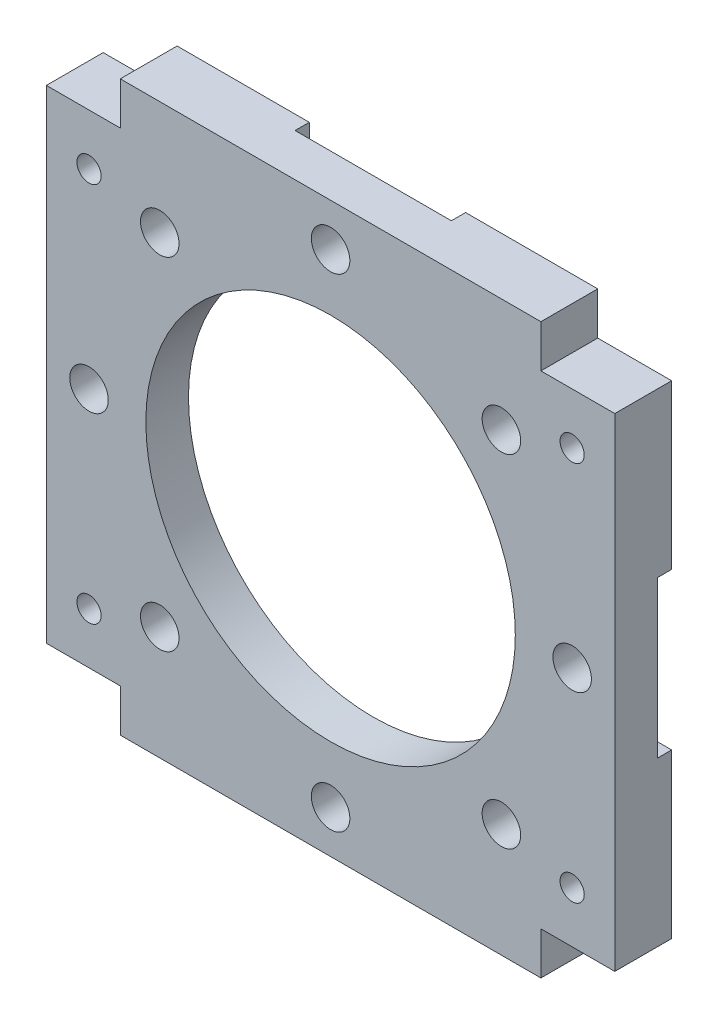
ISO-10303-21;
HEADER;
FILE_DESCRIPTION(('STEP AP214'),'2;1');
FILE_NAME('part.step','',(''),(''),'','','');
FILE_SCHEMA(('AUTOMOTIVE_DESIGN { 1 0 10303 214 1 1 1 1 }'));
ENDSEC;
DATA;
#1=APPLICATION_CONTEXT('core data for automotive mechanical design processes');
#2=APPLICATION_PROTOCOL_DEFINITION('international standard','automotive_design',2000,#1);
#3=PRODUCT_CONTEXT('',#1,'mechanical');
#4=PRODUCT('Part','Part','',(#3));
#5=PRODUCT_RELATED_PRODUCT_CATEGORY('part','',(#4));
#6=PRODUCT_DEFINITION_FORMATION('','',#4);
#7=PRODUCT_DEFINITION_CONTEXT('part definition',#1,'design');
#8=PRODUCT_DEFINITION('design','',#6,#7);
#9=PRODUCT_DEFINITION_SHAPE('','',#8);
#10=(LENGTH_UNIT() NAMED_UNIT(*) SI_UNIT(.MILLI.,.METRE.));
#11=(NAMED_UNIT(*) PLANE_ANGLE_UNIT() SI_UNIT($,.RADIAN.));
#12=(NAMED_UNIT(*) SI_UNIT($,.STERADIAN.) SOLID_ANGLE_UNIT());
#13=UNCERTAINTY_MEASURE_WITH_UNIT(LENGTH_MEASURE(1.E-05),#10,'distance_accuracy_value','');
#14=(GEOMETRIC_REPRESENTATION_CONTEXT(3) GLOBAL_UNCERTAINTY_ASSIGNED_CONTEXT((#13)) GLOBAL_UNIT_ASSIGNED_CONTEXT((#10,
#11,#12)) REPRESENTATION_CONTEXT('',''));
#15=CARTESIAN_POINT('',(0.,0.,0.));
#16=DIRECTION('',(0.,0.,1.));
#17=DIRECTION('',(1.,0.,0.));
#18=AXIS2_PLACEMENT_3D('',#15,#16,#17);
#19=CARTESIAN_POINT('',(31.75,26.9875,4.7625));
#20=DIRECTION('',(-1.,0.,0.));
#21=DIRECTION('',(0.,-1.,0.));
#22=AXIS2_PLACEMENT_3D('',#19,#20,#21);
#23=PLANE('',#22);
#24=DIRECTION('',(0.,0.,1.));
#25=VECTOR('',#24,1.);
#26=CARTESIAN_POINT('',(31.75,8.73125,4.7625));
#27=LINE('',#26,#25);
#28=CARTESIAN_POINT('',(31.75,8.73125,-1.58750000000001));
#29=VERTEX_POINT('',#28);
#30=CARTESIAN_POINT('',(31.75,8.73125,0.));
#31=VERTEX_POINT('',#30);
#32=EDGE_CURVE('E388',#29,#31,#27,.T.);
#33=ORIENTED_EDGE('',*,*,#32,.F.);
#34=DIRECTION('',(0.,1.,0.));
#35=VECTOR('',#34,1.);
#36=CARTESIAN_POINT('',(31.75,26.9875,-1.58750000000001));
#37=LINE('',#36,#35);
#38=CARTESIAN_POINT('',(31.75,26.9875,-1.58750000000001));
#39=VERTEX_POINT('',#38);
#40=EDGE_CURVE('E319',#29,#39,#37,.T.);
#41=ORIENTED_EDGE('',*,*,#40,.T.);
#42=DIRECTION('',(0.,0.,-1.));
#43=VECTOR('',#42,1.);
#44=CARTESIAN_POINT('',(31.75,26.9875,4.7625));
#45=LINE('',#44,#43);
#46=CARTESIAN_POINT('',(31.75,26.9875,4.7625));
#47=VERTEX_POINT('',#46);
#48=EDGE_CURVE('E11',#47,#39,#45,.T.);
#49=ORIENTED_EDGE('',*,*,#48,.F.);
#50=DIRECTION('',(0.,1.,0.));
#51=VECTOR('',#50,1.);
#52=CARTESIAN_POINT('',(31.75,26.9875,4.7625));
#53=LINE('',#52,#51);
#54=CARTESIAN_POINT('',(31.75,-26.9875,4.76249999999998));
#55=VERTEX_POINT('',#54);
#56=EDGE_CURVE('E350',#55,#47,#53,.T.);
#57=ORIENTED_EDGE('',*,*,#56,.F.);
#58=DIRECTION('',(0.,0.,-1.));
#59=VECTOR('',#58,1.);
#60=CARTESIAN_POINT('',(31.75,-26.9875,4.76249999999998));
#61=LINE('',#60,#59);
#62=CARTESIAN_POINT('',(31.75,-26.9875,-1.58750000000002));
#63=VERTEX_POINT('',#62);
#64=EDGE_CURVE('E413',#55,#63,#61,.T.);
#65=ORIENTED_EDGE('',*,*,#64,.T.);
#66=CARTESIAN_POINT('',(31.75,-8.73125,-1.58750000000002));
#67=VERTEX_POINT('',#66);
#68=EDGE_CURVE('E375',#63,#67,#37,.T.);
#69=ORIENTED_EDGE('',*,*,#68,.T.);
#70=DIRECTION('',(0.,0.,-1.));
#71=VECTOR('',#70,1.);
#72=CARTESIAN_POINT('',(31.75,-8.73125,4.76249999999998));
#73=LINE('',#72,#71);
#74=CARTESIAN_POINT('',(31.75,-8.73125,0.));
#75=VERTEX_POINT('',#74);
#76=EDGE_CURVE('E428',#75,#67,#73,.T.);
#77=ORIENTED_EDGE('',*,*,#76,.F.);
#78=DIRECTION('',(0.,-1.,0.));
#79=VECTOR('',#78,1.);
#80=CARTESIAN_POINT('',(31.75,26.9875,0.));
#81=LINE('',#80,#79);
#82=EDGE_CURVE('E444',#31,#75,#81,.T.);
#83=ORIENTED_EDGE('',*,*,#82,.F.);
#84=EDGE_LOOP('',(#33,#41,#49,#57,#65,#69,#77,#83));
#85=FACE_BOUND('',#84,.T.);
#86=ADVANCED_FACE('F33',(#85),#23,.F.);
#87=CARTESIAN_POINT('',(-31.75,-26.9875,4.7625));
#88=DIRECTION('',(1.,0.,0.));
#89=DIRECTION('',(0.,0.,-1.));
#90=AXIS2_PLACEMENT_3D('',#87,#88,#89);
#91=PLANE('',#90);
#92=DIRECTION('',(0.,0.,1.));
#93=VECTOR('',#92,1.);
#94=CARTESIAN_POINT('',(-31.75,-8.73125,4.7625));
#95=LINE('',#94,#93);
#96=CARTESIAN_POINT('',(-31.75,-8.73125,-1.58750000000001));
#97=VERTEX_POINT('',#96);
#98=CARTESIAN_POINT('',(-31.75,-8.73125,0.));
#99=VERTEX_POINT('',#98);
#100=EDGE_CURVE('E469',#97,#99,#95,.T.);
#101=ORIENTED_EDGE('',*,*,#100,.F.);
#102=DIRECTION('',(0.,-1.,0.));
#103=VECTOR('',#102,1.);
#104=CARTESIAN_POINT('',(-31.75,-26.9875,-1.58749999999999));
#105=LINE('',#104,#103);
#106=CARTESIAN_POINT('',(-31.75,-26.9875,-1.58749999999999));
#107=VERTEX_POINT('',#106);
#108=EDGE_CURVE('E398',#97,#107,#105,.T.);
#109=ORIENTED_EDGE('',*,*,#108,.T.);
#110=DIRECTION('',(0.,0.,-1.));
#111=VECTOR('',#110,1.);
#112=CARTESIAN_POINT('',(-31.75,-26.9875,4.7625));
#113=LINE('',#112,#111);
#114=CARTESIAN_POINT('',(-31.75,-26.9875,4.7625));
#115=VERTEX_POINT('',#114);
#116=EDGE_CURVE('E416',#115,#107,#113,.T.);
#117=ORIENTED_EDGE('',*,*,#116,.F.);
#118=DIRECTION('',(0.,-1.,0.));
#119=VECTOR('',#118,1.);
#120=CARTESIAN_POINT('',(-31.75,-26.9875,4.7625));
#121=LINE('',#120,#119);
#122=CARTESIAN_POINT('',(-31.75,26.9875,4.76250000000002));
#123=VERTEX_POINT('',#122);
#124=EDGE_CURVE('E364',#123,#115,#121,.T.);
#125=ORIENTED_EDGE('',*,*,#124,.F.);
#126=DIRECTION('',(0.,0.,-1.));
#127=VECTOR('',#126,1.);
#128=CARTESIAN_POINT('',(-31.75,26.9875,4.76250000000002));
#129=LINE('',#128,#127);
#130=CARTESIAN_POINT('',(-31.75,26.9875,-1.58749999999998));
#131=VERTEX_POINT('',#130);
#132=EDGE_CURVE('E41',#123,#131,#129,.T.);
#133=ORIENTED_EDGE('',*,*,#132,.T.);
#134=CARTESIAN_POINT('',(-31.75,8.73125,-1.58749999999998));
#135=VERTEX_POINT('',#134);
#136=EDGE_CURVE('E356',#131,#135,#105,.T.);
#137=ORIENTED_EDGE('',*,*,#136,.T.);
#138=DIRECTION('',(0.,0.,-1.));
#139=VECTOR('',#138,1.);
#140=CARTESIAN_POINT('',(-31.75,8.73125,4.76250000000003));
#141=LINE('',#140,#139);
#142=CARTESIAN_POINT('',(-31.75,8.73125,0.));
#143=VERTEX_POINT('',#142);
#144=EDGE_CURVE('E462',#143,#135,#141,.T.);
#145=ORIENTED_EDGE('',*,*,#144,.F.);
#146=DIRECTION('',(0.,1.,0.));
#147=VECTOR('',#146,1.);
#148=CARTESIAN_POINT('',(-31.75,-26.9875,0.));
#149=LINE('',#148,#147);
#150=EDGE_CURVE('E231',#99,#143,#149,.T.);
#151=ORIENTED_EDGE('',*,*,#150,.F.);
#152=EDGE_LOOP('',(#101,#109,#117,#125,#133,#137,#145,#151));
#153=FACE_BOUND('',#152,.T.);
#154=ADVANCED_FACE('F507',(#153),#91,.F.);
#155=CARTESIAN_POINT('',(31.75,26.9875,-1.58750000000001));
#156=DIRECTION('',(0.,0.,-1.));
#157=DIRECTION('',(-1.,0.,0.));
#158=AXIS2_PLACEMENT_3D('',#155,#156,#157);
#159=PLANE('',#158);
#160=CARTESIAN_POINT('',(26.9875000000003,21.2687500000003,-1.58750000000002));
#161=DIRECTION('',(0.,0.,-1.));
#162=DIRECTION('',(-1.,0.,0.));
#163=AXIS2_PLACEMENT_3D('',#160,#161,#162);
#164=CIRCLE('',#163,1.35254999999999);
#165=CARTESIAN_POINT('',(25.6349500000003,21.2687500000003,-1.58750000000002));
#166=VERTEX_POINT('',#165);
#167=EDGE_CURVE('E242',#166,#166,#164,.T.);
#168=ORIENTED_EDGE('',*,*,#167,.F.);
#169=EDGE_LOOP('',(#168));
#170=FACE_BOUND('',#169,.T.);
#171=CARTESIAN_POINT('',(0.,2.41368637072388E-13,-1.58750000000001));
#172=DIRECTION('',(0.,0.,-1.));
#173=DIRECTION('',(-1.,0.,0.));
#174=AXIS2_PLACEMENT_3D('',#171,#172,#173);
#175=CIRCLE('',#174,30.2133);
#176=CARTESIAN_POINT('',(8.73125,28.9241900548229,-1.58749999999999));
#177=VERTEX_POINT('',#176);
#178=CARTESIAN_POINT('',(28.9241900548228,8.73125,-1.58749999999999));
#179=VERTEX_POINT('',#178);
#180=EDGE_CURVE('E264',#177,#179,#175,.T.);
#181=ORIENTED_EDGE('',*,*,#180,.F.);
#182=DIRECTION('',(0.,1.,0.));
#183=VECTOR('',#182,1.);
#184=CARTESIAN_POINT('',(8.73125,26.9875,-1.58749999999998));
#185=LINE('',#184,#183);
#186=CARTESIAN_POINT('',(8.73125,31.75,-1.58749999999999));
#187=VERTEX_POINT('',#186);
#188=EDGE_CURVE('E249',#177,#187,#185,.T.);
#189=ORIENTED_EDGE('',*,*,#188,.T.);
#190=DIRECTION('',(-1.,0.,0.));
#191=VECTOR('',#190,1.);
#192=CARTESIAN_POINT('',(-23.495,31.75,-1.58750000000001));
#193=LINE('',#192,#191);
#194=CARTESIAN_POINT('',(23.495,31.75,-1.58750000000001));
#195=VERTEX_POINT('',#194);
#196=EDGE_CURVE('E247',#195,#187,#193,.T.);
#197=ORIENTED_EDGE('',*,*,#196,.F.);
#198=DIRECTION('',(0.,1.,0.));
#199=VECTOR('',#198,1.);
#200=CARTESIAN_POINT('',(23.495,26.9875,-1.58749999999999));
#201=LINE('',#200,#199);
#202=CARTESIAN_POINT('',(23.495,26.9875,-1.58749999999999));
#203=VERTEX_POINT('',#202);
#204=EDGE_CURVE('E333',#203,#195,#201,.T.);
#205=ORIENTED_EDGE('',*,*,#204,.F.);
#206=DIRECTION('',(-1.,0.,0.));
#207=VECTOR('',#206,1.);
#208=CARTESIAN_POINT('',(31.75,26.9875,-1.58750000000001));
#209=LINE('',#208,#207);
#210=EDGE_CURVE('E374',#39,#203,#209,.T.);
#211=ORIENTED_EDGE('',*,*,#210,.F.);
#212=ORIENTED_EDGE('',*,*,#40,.F.);
#213=DIRECTION('',(-1.,0.,0.));
#214=VECTOR('',#213,1.);
#215=CARTESIAN_POINT('',(31.75,8.73125,-1.58750000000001));
#216=LINE('',#215,#214);
#217=EDGE_CURVE('E438',#29,#179,#216,.T.);
#218=ORIENTED_EDGE('',*,*,#217,.T.);
#219=EDGE_LOOP('',(#181,#189,#197,#205,#211,#212,#218));
#220=FACE_BOUND('',#219,.T.);
#221=ADVANCED_FACE('F397',(#170,#220),#159,.T.);
#222=CARTESIAN_POINT('',(26.9875,-21.2687499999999,-1.58749999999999));
#223=DIRECTION('',(0.,0.,-1.));
#224=DIRECTION('',(-1.,0.,0.));
#225=AXIS2_PLACEMENT_3D('',#222,#223,#224);
#226=CIRCLE('',#225,1.35254999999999);
#227=CARTESIAN_POINT('',(25.63495,-21.2687499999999,-1.58749999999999));
#228=VERTEX_POINT('',#227);
#229=EDGE_CURVE('E553',#228,#228,#226,.T.);
#230=ORIENTED_EDGE('',*,*,#229,.F.);
#231=EDGE_LOOP('',(#230));
#232=FACE_BOUND('',#231,.T.);
#233=CARTESIAN_POINT('',(28.9241900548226,-8.73125,-1.58750000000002));
#234=VERTEX_POINT('',#233);
#235=CARTESIAN_POINT('',(8.73125,-28.9241900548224,-1.58749999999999));
#236=VERTEX_POINT('',#235);
#237=EDGE_CURVE('E425',#234,#236,#175,.T.);
#238=ORIENTED_EDGE('',*,*,#237,.F.);
#239=DIRECTION('',(1.,0.,0.));
#240=VECTOR('',#239,1.);
#241=CARTESIAN_POINT('',(31.75,-8.73125,-1.58750000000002));
#242=LINE('',#241,#240);
#243=EDGE_CURVE('E422',#234,#67,#242,.T.);
#244=ORIENTED_EDGE('',*,*,#243,.T.);
#245=ORIENTED_EDGE('',*,*,#68,.F.);
#246=DIRECTION('',(1.,0.,0.));
#247=VECTOR('',#246,1.);
#248=CARTESIAN_POINT('',(31.75,-26.9875,-1.58750000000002));
#249=LINE('',#248,#247);
#250=CARTESIAN_POINT('',(23.495,-26.9875,-1.58750000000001));
#251=VERTEX_POINT('',#250);
#252=EDGE_CURVE('E351',#251,#63,#249,.T.);
#253=ORIENTED_EDGE('',*,*,#252,.F.);
#254=DIRECTION('',(0.,1.,0.));
#255=VECTOR('',#254,1.);
#256=CARTESIAN_POINT('',(23.495,-26.9875,-1.58750000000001));
#257=LINE('',#256,#255);
#258=CARTESIAN_POINT('',(23.495,-31.75,-1.58749999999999));
#259=VERTEX_POINT('',#258);
#260=EDGE_CURVE('E276',#259,#251,#257,.T.);
#261=ORIENTED_EDGE('',*,*,#260,.F.);
#262=DIRECTION('',(1.,0.,0.));
#263=VECTOR('',#262,1.);
#264=CARTESIAN_POINT('',(-23.495,-31.75,-1.58750000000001));
#265=LINE('',#264,#263);
#266=CARTESIAN_POINT('',(8.73125000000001,-31.75,-1.58749999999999));
#267=VERTEX_POINT('',#266);
#268=EDGE_CURVE('E277',#267,#259,#265,.T.);
#269=ORIENTED_EDGE('',*,*,#268,.F.);
#270=DIRECTION('',(0.,1.,0.));
#271=VECTOR('',#270,1.);
#272=CARTESIAN_POINT('',(8.73124999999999,26.9875,-1.58749999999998));
#273=LINE('',#272,#271);
#274=EDGE_CURVE('E481',#267,#236,#273,.T.);
#275=ORIENTED_EDGE('',*,*,#274,.T.);
#276=EDGE_LOOP('',(#238,#244,#245,#253,#261,#269,#275));
#277=FACE_BOUND('',#276,.T.);
#278=ADVANCED_FACE('F421',(#232,#277),#159,.T.);
#279=CARTESIAN_POINT('',(-26.9875,-21.2687499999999,-1.58749999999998));
#280=DIRECTION('',(0.,0.,-1.));
#281=DIRECTION('',(-1.,0.,0.));
#282=AXIS2_PLACEMENT_3D('',#279,#280,#281);
#283=CIRCLE('',#282,1.35254999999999);
#284=CARTESIAN_POINT('',(-28.34005,-21.2687499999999,-1.58749999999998));
#285=VERTEX_POINT('',#284);
#286=EDGE_CURVE('E547',#285,#285,#283,.T.);
#287=ORIENTED_EDGE('',*,*,#286,.F.);
#288=EDGE_LOOP('',(#287));
#289=FACE_BOUND('',#288,.T.);
#290=CARTESIAN_POINT('',(-8.73124999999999,-28.9241900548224,-1.58750000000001));
#291=VERTEX_POINT('',#290);
#292=CARTESIAN_POINT('',(-28.9241900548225,-8.73125,-1.58750000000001));
#293=VERTEX_POINT('',#292);
#294=EDGE_CURVE('E259',#291,#293,#175,.T.);
#295=ORIENTED_EDGE('',*,*,#294,.F.);
#296=DIRECTION('',(0.,-1.,0.));
#297=VECTOR('',#296,1.);
#298=CARTESIAN_POINT('',(-8.73124999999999,26.9875,-1.58750000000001));
#299=LINE('',#298,#297);
#300=CARTESIAN_POINT('',(-8.73124999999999,-31.75,-1.58750000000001));
#301=VERTEX_POINT('',#300);
#302=EDGE_CURVE('E473',#291,#301,#299,.T.);
#303=ORIENTED_EDGE('',*,*,#302,.T.);
#304=CARTESIAN_POINT('',(-23.495,-31.75,-1.58750000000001));
#305=VERTEX_POINT('',#304);
#306=EDGE_CURVE('E273',#305,#301,#265,.T.);
#307=ORIENTED_EDGE('',*,*,#306,.F.);
#308=DIRECTION('',(0.,-1.,0.));
#309=VECTOR('',#308,1.);
#310=CARTESIAN_POINT('',(-23.495,-26.9875,-1.58750000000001));
#311=LINE('',#310,#309);
#312=CARTESIAN_POINT('',(-23.495,-26.9875,-1.58750000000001));
#313=VERTEX_POINT('',#312);
#314=EDGE_CURVE('E293',#313,#305,#311,.T.);
#315=ORIENTED_EDGE('',*,*,#314,.F.);
#316=EDGE_CURVE('E346',#107,#313,#249,.T.);
#317=ORIENTED_EDGE('',*,*,#316,.F.);
#318=ORIENTED_EDGE('',*,*,#108,.F.);
#319=DIRECTION('',(1.,0.,0.));
#320=VECTOR('',#319,1.);
#321=CARTESIAN_POINT('',(31.75,-8.73125,-1.58750000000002));
#322=LINE('',#321,#320);
#323=EDGE_CURVE('E466',#97,#293,#322,.T.);
#324=ORIENTED_EDGE('',*,*,#323,.T.);
#325=EDGE_LOOP('',(#295,#303,#307,#315,#317,#318,#324));
#326=FACE_BOUND('',#325,.T.);
#327=ADVANCED_FACE('F900',(#289,#326),#159,.T.);
#328=CARTESIAN_POINT('',(-26.9874999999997,21.2687500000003,-1.58750000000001));
#329=DIRECTION('',(0.,0.,-1.));
#330=DIRECTION('',(-1.,0.,0.));
#331=AXIS2_PLACEMENT_3D('',#328,#329,#330);
#332=CIRCLE('',#331,1.35254999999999);
#333=CARTESIAN_POINT('',(-28.3400499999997,21.2687500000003,-1.58750000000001));
#334=VERTEX_POINT('',#333);
#335=EDGE_CURVE('E541',#334,#334,#332,.T.);
#336=ORIENTED_EDGE('',*,*,#335,.F.);
#337=EDGE_LOOP('',(#336));
#338=FACE_BOUND('',#337,.T.);
#339=CARTESIAN_POINT('',(-28.9241900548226,8.73125,-1.58749999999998));
#340=VERTEX_POINT('',#339);
#341=CARTESIAN_POINT('',(-8.73125,28.9241900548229,-1.58750000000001));
#342=VERTEX_POINT('',#341);
#343=EDGE_CURVE('E260',#340,#342,#175,.T.);
#344=ORIENTED_EDGE('',*,*,#343,.F.);
#345=DIRECTION('',(-1.,0.,0.));
#346=VECTOR('',#345,1.);
#347=CARTESIAN_POINT('',(31.75,8.73125,-1.58750000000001));
#348=LINE('',#347,#346);
#349=EDGE_CURVE('E459',#340,#135,#348,.T.);
#350=ORIENTED_EDGE('',*,*,#349,.T.);
#351=ORIENTED_EDGE('',*,*,#136,.F.);
#352=CARTESIAN_POINT('',(-23.495,26.9875,-1.58750000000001));
#353=VERTEX_POINT('',#352);
#354=EDGE_CURVE('E372',#353,#131,#209,.T.);
#355=ORIENTED_EDGE('',*,*,#354,.F.);
#356=DIRECTION('',(0.,-1.,0.));
#357=VECTOR('',#356,1.);
#358=CARTESIAN_POINT('',(-23.495,26.9875,-1.58750000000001));
#359=LINE('',#358,#357);
#360=CARTESIAN_POINT('',(-23.495,31.75,-1.58750000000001));
#361=VERTEX_POINT('',#360);
#362=EDGE_CURVE('E312',#361,#353,#359,.T.);
#363=ORIENTED_EDGE('',*,*,#362,.F.);
#364=CARTESIAN_POINT('',(-8.73125,31.75,-1.58750000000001));
#365=VERTEX_POINT('',#364);
#366=EDGE_CURVE('E316',#365,#361,#193,.T.);
#367=ORIENTED_EDGE('',*,*,#366,.F.);
#368=DIRECTION('',(0.,-1.,0.));
#369=VECTOR('',#368,1.);
#370=CARTESIAN_POINT('',(-8.73125,26.9875,-1.58750000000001));
#371=LINE('',#370,#369);
#372=EDGE_CURVE('E448',#365,#342,#371,.T.);
#373=ORIENTED_EDGE('',*,*,#372,.T.);
#374=EDGE_LOOP('',(#344,#350,#351,#355,#363,#367,#373));
#375=FACE_BOUND('',#374,.T.);
#376=ADVANCED_FACE('F513',(#338,#375),#159,.T.);
#377=CARTESIAN_POINT('',(-23.495,31.75,-1.58750000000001));
#378=DIRECTION('',(0.,1.,0.));
#379=DIRECTION('',(0.,0.,1.));
#380=AXIS2_PLACEMENT_3D('',#377,#378,#379);
#381=PLANE('',#380);
#382=ORIENTED_EDGE('',*,*,#196,.T.);
#383=DIRECTION('',(0.,0.,1.));
#384=VECTOR('',#383,1.);
#385=CARTESIAN_POINT('',(8.73125,31.75,-1.58749999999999));
#386=LINE('',#385,#384);
#387=CARTESIAN_POINT('',(8.73125,31.75,0.));
#388=VERTEX_POINT('',#387);
#389=EDGE_CURVE('E236',#187,#388,#386,.T.);
#390=ORIENTED_EDGE('',*,*,#389,.T.);
#391=DIRECTION('',(-1.,0.,0.));
#392=VECTOR('',#391,1.);
#393=CARTESIAN_POINT('',(-23.495,31.75,0.));
#394=LINE('',#393,#392);
#395=CARTESIAN_POINT('',(-8.73124999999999,31.75,0.));
#396=VERTEX_POINT('',#395);
#397=EDGE_CURVE('E219',#388,#396,#394,.T.);
#398=ORIENTED_EDGE('',*,*,#397,.T.);
#399=DIRECTION('',(0.,0.,-1.));
#400=VECTOR('',#399,1.);
#401=CARTESIAN_POINT('',(-8.73124999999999,31.75,-1.58750000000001));
#402=LINE('',#401,#400);
#403=EDGE_CURVE('E454',#396,#365,#402,.T.);
#404=ORIENTED_EDGE('',*,*,#403,.T.);
#405=ORIENTED_EDGE('',*,*,#366,.T.);
#406=DIRECTION('',(0.,0.,1.));
#407=VECTOR('',#406,1.);
#408=CARTESIAN_POINT('',(-23.495,31.75,-1.58750000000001));
#409=LINE('',#408,#407);
#410=CARTESIAN_POINT('',(-23.495,31.75,4.7625));
#411=VERTEX_POINT('',#410);
#412=EDGE_CURVE('E317',#361,#411,#409,.T.);
#413=ORIENTED_EDGE('',*,*,#412,.T.);
#414=DIRECTION('',(-1.,0.,0.));
#415=VECTOR('',#414,1.);
#416=CARTESIAN_POINT('',(-23.495,31.75,4.7625));
#417=LINE('',#416,#415);
#418=CARTESIAN_POINT('',(23.495,31.75,4.7625));
#419=VERTEX_POINT('',#418);
#420=EDGE_CURVE('E309',#419,#411,#417,.T.);
#421=ORIENTED_EDGE('',*,*,#420,.F.);
#422=DIRECTION('',(0.,0.,1.));
#423=VECTOR('',#422,1.);
#424=CARTESIAN_POINT('',(23.495,31.75,-1.58750000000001));
#425=LINE('',#424,#423);
#426=EDGE_CURVE('E320',#195,#419,#425,.T.);
#427=ORIENTED_EDGE('',*,*,#426,.F.);
#428=EDGE_LOOP('',(#382,#390,#398,#404,#405,#413,#421,#427));
#429=FACE_BOUND('',#428,.T.);
#430=ADVANCED_FACE('F245',(#429),#381,.T.);
#431=CARTESIAN_POINT('',(-23.495,-31.75,-1.58750000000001));
#432=DIRECTION('',(0.,-1.,0.));
#433=DIRECTION('',(0.,0.,-1.));
#434=AXIS2_PLACEMENT_3D('',#431,#432,#433);
#435=PLANE('',#434);
#436=DIRECTION('',(1.,0.,0.));
#437=VECTOR('',#436,1.);
#438=CARTESIAN_POINT('',(-23.495,-31.75,0.));
#439=LINE('',#438,#437);
#440=CARTESIAN_POINT('',(-8.73124999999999,-31.75,0.));
#441=VERTEX_POINT('',#440);
#442=CARTESIAN_POINT('',(8.73125,-31.75,0.));
#443=VERTEX_POINT('',#442);
#444=EDGE_CURVE('E232',#441,#443,#439,.T.);
#445=ORIENTED_EDGE('',*,*,#444,.T.);
#446=DIRECTION('',(0.,0.,-1.));
#447=VECTOR('',#446,1.);
#448=CARTESIAN_POINT('',(8.73125,-31.75,-1.58749999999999));
#449=LINE('',#448,#447);
#450=EDGE_CURVE('E433',#443,#267,#449,.T.);
#451=ORIENTED_EDGE('',*,*,#450,.T.);
#452=ORIENTED_EDGE('',*,*,#268,.T.);
#453=DIRECTION('',(0.,0.,1.));
#454=VECTOR('',#453,1.);
#455=CARTESIAN_POINT('',(23.495,-31.75,-1.58749999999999));
#456=LINE('',#455,#454);
#457=CARTESIAN_POINT('',(23.495,-31.75,4.7625));
#458=VERTEX_POINT('',#457);
#459=EDGE_CURVE('E280',#259,#458,#456,.T.);
#460=ORIENTED_EDGE('',*,*,#459,.T.);
#461=DIRECTION('',(1.,0.,0.));
#462=VECTOR('',#461,1.);
#463=CARTESIAN_POINT('',(-23.495,-31.75,4.7625));
#464=LINE('',#463,#462);
#465=CARTESIAN_POINT('',(-23.495,-31.75,4.7625));
#466=VERTEX_POINT('',#465);
#467=EDGE_CURVE('E269',#466,#458,#464,.T.);
#468=ORIENTED_EDGE('',*,*,#467,.F.);
#469=DIRECTION('',(0.,0.,1.));
#470=VECTOR('',#469,1.);
#471=CARTESIAN_POINT('',(-23.495,-31.75,-1.58750000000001));
#472=LINE('',#471,#470);
#473=EDGE_CURVE('E304',#305,#466,#472,.T.);
#474=ORIENTED_EDGE('',*,*,#473,.F.);
#475=ORIENTED_EDGE('',*,*,#306,.T.);
#476=DIRECTION('',(0.,0.,1.));
#477=VECTOR('',#476,1.);
#478=CARTESIAN_POINT('',(-8.73124999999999,-31.75,-1.58750000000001));
#479=LINE('',#478,#477);
#480=EDGE_CURVE('E476',#301,#441,#479,.T.);
#481=ORIENTED_EDGE('',*,*,#480,.T.);
#482=EDGE_LOOP('',(#445,#451,#452,#460,#468,#474,#475,#481));
#483=FACE_BOUND('',#482,.T.);
#484=ADVANCED_FACE('F486',(#483),#435,.T.);
#485=CARTESIAN_POINT('',(0.,2.41368637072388E-13,0.));
#486=DIRECTION('',(0.,0.,-1.));
#487=DIRECTION('',(-1.,0.,0.));
#488=AXIS2_PLACEMENT_3D('',#485,#486,#487);
#489=CYLINDRICAL_SURFACE('',#488,30.2133);
#490=DIRECTION('',(0.,0.,-1.));
#491=VECTOR('',#490,1.);
#492=CARTESIAN_POINT('',(8.73125,28.9241900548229,0.));
#493=LINE('',#492,#491);
#494=CARTESIAN_POINT('',(8.73125,28.9241900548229,0.));
#495=VERTEX_POINT('',#494);
#496=EDGE_CURVE('E239',#177,#495,#493,.F.);
#497=ORIENTED_EDGE('',*,*,#496,.F.);
#498=ORIENTED_EDGE('',*,*,#180,.T.);
#499=DIRECTION('',(0.,0.,-1.));
#500=VECTOR('',#499,1.);
#501=CARTESIAN_POINT('',(28.9241900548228,8.73125,0.));
#502=LINE('',#501,#500);
#503=CARTESIAN_POINT('',(28.9241900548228,8.73125,0.));
#504=VERTEX_POINT('',#503);
#505=EDGE_CURVE('E431',#504,#179,#502,.T.);
#506=ORIENTED_EDGE('',*,*,#505,.F.);
#507=CARTESIAN_POINT('',(0.,2.41368637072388E-13,0.));
#508=DIRECTION('',(0.,0.,-1.));
#509=DIRECTION('',(-1.,0.,0.));
#510=AXIS2_PLACEMENT_3D('',#507,#508,#509);
#511=CIRCLE('',#510,30.2133);
#512=EDGE_CURVE('E268',#495,#504,#511,.T.);
#513=ORIENTED_EDGE('',*,*,#512,.F.);
#514=EDGE_LOOP('',(#497,#498,#506,#513));
#515=FACE_BOUND('',#514,.T.);
#516=ADVANCED_FACE('F936',(#515),#489,.F.);
#517=DIRECTION('',(0.,0.,-1.));
#518=VECTOR('',#517,1.);
#519=CARTESIAN_POINT('',(28.9241900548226,-8.73125,0.));
#520=LINE('',#519,#518);
#521=CARTESIAN_POINT('',(28.9241900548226,-8.73125,0.));
#522=VERTEX_POINT('',#521);
#523=EDGE_CURVE('E429',#234,#522,#520,.F.);
#524=ORIENTED_EDGE('',*,*,#523,.F.);
#525=ORIENTED_EDGE('',*,*,#237,.T.);
#526=DIRECTION('',(0.,0.,-1.));
#527=VECTOR('',#526,1.);
#528=CARTESIAN_POINT('',(8.73125,-28.9241900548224,0.));
#529=LINE('',#528,#527);
#530=CARTESIAN_POINT('',(8.73125,-28.9241900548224,0.));
#531=VERTEX_POINT('',#530);
#532=EDGE_CURVE('E479',#531,#236,#529,.T.);
#533=ORIENTED_EDGE('',*,*,#532,.F.);
#534=EDGE_CURVE('E1035',#522,#531,#511,.T.);
#535=ORIENTED_EDGE('',*,*,#534,.F.);
#536=EDGE_LOOP('',(#524,#525,#533,#535));
#537=FACE_BOUND('',#536,.T.);
#538=ADVANCED_FACE('F945',(#537),#489,.F.);
#539=DIRECTION('',(0.,0.,-1.));
#540=VECTOR('',#539,1.);
#541=CARTESIAN_POINT('',(-8.73124999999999,-28.9241900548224,0.));
#542=LINE('',#541,#540);
#543=CARTESIAN_POINT('',(-8.73124999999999,-28.9241900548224,0.));
#544=VERTEX_POINT('',#543);
#545=EDGE_CURVE('E471',#291,#544,#542,.F.);
#546=ORIENTED_EDGE('',*,*,#545,.F.);
#547=ORIENTED_EDGE('',*,*,#294,.T.);
#548=DIRECTION('',(0.,0.,-1.));
#549=VECTOR('',#548,1.);
#550=CARTESIAN_POINT('',(-28.9241900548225,-8.73125,0.));
#551=LINE('',#550,#549);
#552=CARTESIAN_POINT('',(-28.9241900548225,-8.73125,0.));
#553=VERTEX_POINT('',#552);
#554=EDGE_CURVE('E464',#553,#293,#551,.T.);
#555=ORIENTED_EDGE('',*,*,#554,.F.);
#556=EDGE_CURVE('E263',#544,#553,#511,.T.);
#557=ORIENTED_EDGE('',*,*,#556,.F.);
#558=EDGE_LOOP('',(#546,#547,#555,#557));
#559=FACE_BOUND('',#558,.T.);
#560=ADVANCED_FACE('F955',(#559),#489,.F.);
#561=DIRECTION('',(0.,0.,-1.));
#562=VECTOR('',#561,1.);
#563=CARTESIAN_POINT('',(-28.9241900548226,8.73125,0.));
#564=LINE('',#563,#562);
#565=CARTESIAN_POINT('',(-28.9241900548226,8.73125,0.));
#566=VERTEX_POINT('',#565);
#567=EDGE_CURVE('E456',#340,#566,#564,.F.);
#568=ORIENTED_EDGE('',*,*,#567,.F.);
#569=ORIENTED_EDGE('',*,*,#343,.T.);
#570=DIRECTION('',(0.,0.,-1.));
#571=VECTOR('',#570,1.);
#572=CARTESIAN_POINT('',(-8.73125,28.9241900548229,0.));
#573=LINE('',#572,#571);
#574=CARTESIAN_POINT('',(-8.73125,28.9241900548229,0.));
#575=VERTEX_POINT('',#574);
#576=EDGE_CURVE('E446',#575,#342,#573,.T.);
#577=ORIENTED_EDGE('',*,*,#576,.F.);
#578=EDGE_CURVE('E265',#566,#575,#511,.T.);
#579=ORIENTED_EDGE('',*,*,#578,.F.);
#580=EDGE_LOOP('',(#568,#569,#577,#579));
#581=FACE_BOUND('',#580,.T.);
#582=ADVANCED_FACE('F521',(#581),#489,.F.);
#583=CARTESIAN_POINT('',(31.75,-26.9875,4.76249999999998));
#584=DIRECTION('',(0.,1.,0.));
#585=DIRECTION('',(0.,0.,1.));
#586=AXIS2_PLACEMENT_3D('',#583,#584,#585);
#587=PLANE('',#586);
#588=DIRECTION('',(0.,0.,1.));
#589=VECTOR('',#588,1.);
#590=CARTESIAN_POINT('',(23.495,-26.9875,-1.58750000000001));
#591=LINE('',#590,#589);
#592=CARTESIAN_POINT('',(23.495,-26.9875,4.7625));
#593=VERTEX_POINT('',#592);
#594=EDGE_CURVE('E283',#251,#593,#591,.T.);
#595=ORIENTED_EDGE('',*,*,#594,.F.);
#596=ORIENTED_EDGE('',*,*,#252,.T.);
#597=ORIENTED_EDGE('',*,*,#64,.F.);
#598=DIRECTION('',(1.,0.,0.));
#599=VECTOR('',#598,1.);
#600=CARTESIAN_POINT('',(31.75,-26.9875,4.76249999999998));
#601=LINE('',#600,#599);
#602=EDGE_CURVE('E500',#593,#55,#601,.T.);
#603=ORIENTED_EDGE('',*,*,#602,.F.);
#604=EDGE_LOOP('',(#595,#596,#597,#603));
#605=FACE_BOUND('',#604,.T.);
#606=ADVANCED_FACE('F412',(#605),#587,.F.);
#607=CARTESIAN_POINT('',(31.75,26.9875,4.7625));
#608=DIRECTION('',(0.,-1.,0.));
#609=DIRECTION('',(1.,0.,0.));
#610=AXIS2_PLACEMENT_3D('',#607,#608,#609);
#611=PLANE('',#610);
#612=DIRECTION('',(0.,0.,1.));
#613=VECTOR('',#612,1.);
#614=CARTESIAN_POINT('',(-23.495,26.9875,-1.58750000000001));
#615=LINE('',#614,#613);
#616=CARTESIAN_POINT('',(-23.495,26.9875,4.7625));
#617=VERTEX_POINT('',#616);
#618=EDGE_CURVE('E315',#353,#617,#615,.T.);
#619=ORIENTED_EDGE('',*,*,#618,.F.);
#620=ORIENTED_EDGE('',*,*,#354,.T.);
#621=ORIENTED_EDGE('',*,*,#132,.F.);
#622=DIRECTION('',(-1.,0.,0.));
#623=VECTOR('',#622,1.);
#624=CARTESIAN_POINT('',(31.75,26.9875,4.7625));
#625=LINE('',#624,#623);
#626=EDGE_CURVE('E361',#617,#123,#625,.T.);
#627=ORIENTED_EDGE('',*,*,#626,.F.);
#628=EDGE_LOOP('',(#619,#620,#621,#627));
#629=FACE_BOUND('',#628,.T.);
#630=ADVANCED_FACE('F674',(#629),#611,.F.);
#631=ORIENTED_EDGE('',*,*,#210,.T.);
#632=DIRECTION('',(0.,0.,1.));
#633=VECTOR('',#632,1.);
#634=CARTESIAN_POINT('',(23.495,26.9875,-1.58749999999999));
#635=LINE('',#634,#633);
#636=CARTESIAN_POINT('',(23.495,26.9875,4.7625));
#637=VERTEX_POINT('',#636);
#638=EDGE_CURVE('E322',#203,#637,#635,.T.);
#639=ORIENTED_EDGE('',*,*,#638,.T.);
#640=EDGE_CURVE('E369',#47,#637,#625,.T.);
#641=ORIENTED_EDGE('',*,*,#640,.F.);
#642=ORIENTED_EDGE('',*,*,#48,.T.);
#643=EDGE_LOOP('',(#631,#639,#641,#642));
#644=FACE_BOUND('',#643,.T.);
#645=ADVANCED_FACE('F394',(#644),#611,.F.);
#646=ORIENTED_EDGE('',*,*,#316,.T.);
#647=DIRECTION('',(0.,0.,1.));
#648=VECTOR('',#647,1.);
#649=CARTESIAN_POINT('',(-23.495,-26.9875,-1.58750000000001));
#650=LINE('',#649,#648);
#651=CARTESIAN_POINT('',(-23.495,-26.9875,4.76249999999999));
#652=VERTEX_POINT('',#651);
#653=EDGE_CURVE('E290',#313,#652,#650,.T.);
#654=ORIENTED_EDGE('',*,*,#653,.T.);
#655=EDGE_CURVE('E417',#115,#652,#601,.T.);
#656=ORIENTED_EDGE('',*,*,#655,.F.);
#657=ORIENTED_EDGE('',*,*,#116,.T.);
#658=EDGE_LOOP('',(#646,#654,#656,#657));
#659=FACE_BOUND('',#658,.T.);
#660=ADVANCED_FACE('F640',(#659),#587,.F.);
#661=CARTESIAN_POINT('',(31.75,26.9875,4.7625));
#662=DIRECTION('',(0.,0.,-1.));
#663=DIRECTION('',(-1.,0.,0.));
#664=AXIS2_PLACEMENT_3D('',#661,#662,#663);
#665=PLANE('',#664);
#666=CARTESIAN_POINT('',(0.,26.9875,4.7625));
#667=DIRECTION('',(0.,0.,-1.));
#668=DIRECTION('',(-1.,0.,0.));
#669=AXIS2_PLACEMENT_3D('',#666,#667,#668);
#670=CIRCLE('',#669,2.15264999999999);
#671=CARTESIAN_POINT('',(-2.15264999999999,26.9875,4.7625));
#672=VERTEX_POINT('',#671);
#673=EDGE_CURVE('E601',#672,#672,#670,.T.);
#674=ORIENTED_EDGE('',*,*,#673,.T.);
#675=EDGE_LOOP('',(#674));
#676=FACE_BOUND('',#675,.T.);
#677=CARTESIAN_POINT('',(-19.0830442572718,19.083044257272,4.7625));
#678=DIRECTION('',(0.,0.,-1.));
#679=DIRECTION('',(-1.,0.,0.));
#680=AXIS2_PLACEMENT_3D('',#677,#678,#679);
#681=CIRCLE('',#680,2.15264999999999);
#682=CARTESIAN_POINT('',(-21.2356942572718,19.083044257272,4.7625));
#683=VERTEX_POINT('',#682);
#684=EDGE_CURVE('E595',#683,#683,#681,.T.);
#685=ORIENTED_EDGE('',*,*,#684,.T.);
#686=EDGE_LOOP('',(#685));
#687=FACE_BOUND('',#686,.T.);
#688=CARTESIAN_POINT('',(-26.9874999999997,1.07986536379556E-13,4.7625));
#689=DIRECTION('',(0.,0.,-1.));
#690=DIRECTION('',(-1.,0.,0.));
#691=AXIS2_PLACEMENT_3D('',#688,#689,#690);
#692=CIRCLE('',#691,2.15264999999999);
#693=CARTESIAN_POINT('',(-29.1401499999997,1.07986536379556E-13,4.7625));
#694=VERTEX_POINT('',#693);
#695=EDGE_CURVE('E589',#694,#694,#692,.T.);
#696=ORIENTED_EDGE('',*,*,#695,.T.);
#697=EDGE_LOOP('',(#696));
#698=FACE_BOUND('',#697,.T.);
#699=CARTESIAN_POINT('',(-19.0830442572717,-19.0830442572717,4.76250000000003));
#700=DIRECTION('',(0.,0.,-1.));
#701=DIRECTION('',(-1.,0.,0.));
#702=AXIS2_PLACEMENT_3D('',#699,#700,#701);
#703=CIRCLE('',#702,2.15264999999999);
#704=CARTESIAN_POINT('',(-21.2356942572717,-19.0830442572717,4.76250000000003));
#705=VERTEX_POINT('',#704);
#706=EDGE_CURVE('E583',#705,#705,#703,.T.);
#707=ORIENTED_EDGE('',*,*,#706,.T.);
#708=EDGE_LOOP('',(#707));
#709=FACE_BOUND('',#708,.T.);
#710=CARTESIAN_POINT('',(1.34441069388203E-13,-26.9874999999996,4.7625));
#711=DIRECTION('',(0.,0.,-1.));
#712=DIRECTION('',(-1.,0.,0.));
#713=AXIS2_PLACEMENT_3D('',#710,#711,#712);
#714=CIRCLE('',#713,2.15264999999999);
#715=CARTESIAN_POINT('',(-2.15264999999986,-26.9874999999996,4.7625));
#716=VERTEX_POINT('',#715);
#717=EDGE_CURVE('E577',#716,#716,#714,.T.);
#718=ORIENTED_EDGE('',*,*,#717,.T.);
#719=EDGE_LOOP('',(#718));
#720=FACE_BOUND('',#719,.T.);
#721=CARTESIAN_POINT('',(19.0830442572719,-19.0830442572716,4.7625));
#722=DIRECTION('',(0.,0.,-1.));
#723=DIRECTION('',(-1.,0.,0.));
#724=AXIS2_PLACEMENT_3D('',#721,#722,#723);
#725=CIRCLE('',#724,2.15264999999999);
#726=CARTESIAN_POINT('',(16.9303942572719,-19.0830442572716,4.7625));
#727=VERTEX_POINT('',#726);
#728=EDGE_CURVE('E571',#727,#727,#725,.T.);
#729=ORIENTED_EDGE('',*,*,#728,.T.);
#730=EDGE_LOOP('',(#729));
#731=FACE_BOUND('',#730,.T.);
#732=CARTESIAN_POINT('',(26.9874999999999,2.33320307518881E-13,4.7625));
#733=DIRECTION('',(0.,0.,-1.));
#734=DIRECTION('',(-1.,0.,0.));
#735=AXIS2_PLACEMENT_3D('',#732,#733,#734);
#736=CIRCLE('',#735,2.15264999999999);
#737=CARTESIAN_POINT('',(24.8348499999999,2.33320307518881E-13,4.7625));
#738=VERTEX_POINT('',#737);
#739=EDGE_CURVE('E565',#738,#738,#736,.T.);
#740=ORIENTED_EDGE('',*,*,#739,.T.);
#741=EDGE_LOOP('',(#740));
#742=FACE_BOUND('',#741,.T.);
#743=CARTESIAN_POINT('',(19.0830442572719,19.083044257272,4.76249999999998));
#744=DIRECTION('',(0.,0.,-1.));
#745=DIRECTION('',(-1.,0.,0.));
#746=AXIS2_PLACEMENT_3D('',#743,#744,#745);
#747=CIRCLE('',#746,2.15264999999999);
#748=CARTESIAN_POINT('',(16.9303942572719,19.083044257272,4.76249999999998));
#749=VERTEX_POINT('',#748);
#750=EDGE_CURVE('E559',#749,#749,#747,.T.);
#751=ORIENTED_EDGE('',*,*,#750,.T.);
#752=EDGE_LOOP('',(#751));
#753=FACE_BOUND('',#752,.T.);
#754=CARTESIAN_POINT('',(26.9875,-21.2687499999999,4.7625));
#755=DIRECTION('',(0.,0.,1.));
#756=DIRECTION('',(1.,0.,0.));
#757=AXIS2_PLACEMENT_3D('',#754,#755,#756);
#758=CIRCLE('',#757,1.35254999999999);
#759=CARTESIAN_POINT('',(28.34005,-21.2687499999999,4.7625));
#760=VERTEX_POINT('',#759);
#761=EDGE_CURVE('E556',#760,#760,#758,.T.);
#762=ORIENTED_EDGE('',*,*,#761,.F.);
#763=EDGE_LOOP('',(#762));
#764=FACE_BOUND('',#763,.T.);
#765=CARTESIAN_POINT('',(-26.9875,-21.2687499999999,4.76250000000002));
#766=DIRECTION('',(0.,0.,1.));
#767=DIRECTION('',(1.,0.,0.));
#768=AXIS2_PLACEMENT_3D('',#765,#766,#767);
#769=CIRCLE('',#768,1.35254999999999);
#770=CARTESIAN_POINT('',(-25.63495,-21.2687499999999,4.76250000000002));
#771=VERTEX_POINT('',#770);
#772=EDGE_CURVE('E550',#771,#771,#769,.T.);
#773=ORIENTED_EDGE('',*,*,#772,.F.);
#774=EDGE_LOOP('',(#773));
#775=FACE_BOUND('',#774,.T.);
#776=CARTESIAN_POINT('',(-26.9874999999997,21.2687500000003,4.7625));
#777=DIRECTION('',(0.,0.,1.));
#778=DIRECTION('',(1.,0.,0.));
#779=AXIS2_PLACEMENT_3D('',#776,#777,#778);
#780=CIRCLE('',#779,1.35254999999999);
#781=CARTESIAN_POINT('',(-25.6349499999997,21.2687500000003,4.7625));
#782=VERTEX_POINT('',#781);
#783=EDGE_CURVE('E544',#782,#782,#780,.T.);
#784=ORIENTED_EDGE('',*,*,#783,.F.);
#785=EDGE_LOOP('',(#784));
#786=FACE_BOUND('',#785,.T.);
#787=CARTESIAN_POINT('',(26.9875000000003,21.2687500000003,4.76249999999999));
#788=DIRECTION('',(0.,0.,1.));
#789=DIRECTION('',(1.,0.,0.));
#790=AXIS2_PLACEMENT_3D('',#787,#788,#789);
#791=CIRCLE('',#790,1.35254999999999);
#792=CARTESIAN_POINT('',(28.3400500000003,21.2687500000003,4.76249999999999));
#793=VERTEX_POINT('',#792);
#794=EDGE_CURVE('E538',#793,#793,#791,.T.);
#795=ORIENTED_EDGE('',*,*,#794,.F.);
#796=EDGE_LOOP('',(#795));
#797=FACE_BOUND('',#796,.T.);
#798=CARTESIAN_POINT('',(0.,2.41368637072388E-13,4.7625));
#799=DIRECTION('',(0.,0.,-1.));
#800=DIRECTION('',(-1.,0.,0.));
#801=AXIS2_PLACEMENT_3D('',#798,#799,#800);
#802=CIRCLE('',#801,20.6374999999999);
#803=CARTESIAN_POINT('',(-20.6374999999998,2.41368637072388E-13,4.7625));
#804=VERTEX_POINT('',#803);
#805=EDGE_CURVE('E252',#804,#804,#802,.T.);
#806=ORIENTED_EDGE('',*,*,#805,.T.);
#807=EDGE_LOOP('',(#806));
#808=FACE_BOUND('',#807,.T.);
#809=ORIENTED_EDGE('',*,*,#56,.T.);
#810=ORIENTED_EDGE('',*,*,#640,.T.);
#811=DIRECTION('',(0.,1.,0.));
#812=VECTOR('',#811,1.);
#813=CARTESIAN_POINT('',(23.495,26.9875,4.7625));
#814=LINE('',#813,#812);
#815=EDGE_CURVE('E313',#637,#419,#814,.T.);
#816=ORIENTED_EDGE('',*,*,#815,.T.);
#817=ORIENTED_EDGE('',*,*,#420,.T.);
#818=DIRECTION('',(0.,-1.,0.));
#819=VECTOR('',#818,1.);
#820=CARTESIAN_POINT('',(-23.495,26.9875,4.7625));
#821=LINE('',#820,#819);
#822=EDGE_CURVE('E286',#411,#617,#821,.T.);
#823=ORIENTED_EDGE('',*,*,#822,.T.);
#824=ORIENTED_EDGE('',*,*,#626,.T.);
#825=ORIENTED_EDGE('',*,*,#124,.T.);
#826=ORIENTED_EDGE('',*,*,#655,.T.);
#827=DIRECTION('',(0.,-1.,0.));
#828=VECTOR('',#827,1.);
#829=CARTESIAN_POINT('',(-23.495,-26.9875,4.76249999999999));
#830=LINE('',#829,#828);
#831=EDGE_CURVE('E267',#652,#466,#830,.T.);
#832=ORIENTED_EDGE('',*,*,#831,.T.);
#833=ORIENTED_EDGE('',*,*,#467,.T.);
#834=DIRECTION('',(0.,1.,0.));
#835=VECTOR('',#834,1.);
#836=CARTESIAN_POINT('',(23.495,-26.9875,4.7625));
#837=LINE('',#836,#835);
#838=EDGE_CURVE('E272',#458,#593,#837,.T.);
#839=ORIENTED_EDGE('',*,*,#838,.T.);
#840=ORIENTED_EDGE('',*,*,#602,.T.);
#841=EDGE_LOOP('',(#809,#810,#816,#817,#823,#824,#825,#826,#832,#833,#839,#840));
#842=FACE_BOUND('',#841,.T.);
#843=ADVANCED_FACE('F497',(#676,#687,#698,#709,#720,#731,#742,#753,#764,#775,#786,#797,#808,
#842),#665,.F.);
#844=CARTESIAN_POINT('',(-23.495,26.9875,-1.58750000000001));
#845=DIRECTION('',(-1.,0.,0.));
#846=DIRECTION('',(0.,0.,1.));
#847=AXIS2_PLACEMENT_3D('',#844,#845,#846);
#848=PLANE('',#847);
#849=ORIENTED_EDGE('',*,*,#822,.F.);
#850=ORIENTED_EDGE('',*,*,#412,.F.);
#851=ORIENTED_EDGE('',*,*,#362,.T.);
#852=ORIENTED_EDGE('',*,*,#618,.T.);
#853=EDGE_LOOP('',(#849,#850,#851,#852));
#854=FACE_BOUND('',#853,.T.);
#855=ADVANCED_FACE('F639',(#854),#848,.T.);
#856=CARTESIAN_POINT('',(23.495,26.9875,-1.58749999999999));
#857=DIRECTION('',(1.,0.,0.));
#858=DIRECTION('',(0.,0.,-1.));
#859=AXIS2_PLACEMENT_3D('',#856,#857,#858);
#860=PLANE('',#859);
#861=ORIENTED_EDGE('',*,*,#815,.F.);
#862=ORIENTED_EDGE('',*,*,#638,.F.);
#863=ORIENTED_EDGE('',*,*,#204,.T.);
#864=ORIENTED_EDGE('',*,*,#426,.T.);
#865=EDGE_LOOP('',(#861,#862,#863,#864));
#866=FACE_BOUND('',#865,.T.);
#867=ADVANCED_FACE('F1006',(#866),#860,.T.);
#868=CARTESIAN_POINT('',(23.495,-26.9875,-1.58750000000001));
#869=DIRECTION('',(1.,0.,0.));
#870=DIRECTION('',(0.,0.,-1.));
#871=AXIS2_PLACEMENT_3D('',#868,#869,#870);
#872=PLANE('',#871);
#873=ORIENTED_EDGE('',*,*,#838,.F.);
#874=ORIENTED_EDGE('',*,*,#459,.F.);
#875=ORIENTED_EDGE('',*,*,#260,.T.);
#876=ORIENTED_EDGE('',*,*,#594,.T.);
#877=EDGE_LOOP('',(#873,#874,#875,#876));
#878=FACE_BOUND('',#877,.T.);
#879=ADVANCED_FACE('F491',(#878),#872,.T.);
#880=CARTESIAN_POINT('',(-23.495,-26.9875,-1.58750000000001));
#881=DIRECTION('',(-1.,0.,0.));
#882=DIRECTION('',(0.,0.,1.));
#883=AXIS2_PLACEMENT_3D('',#880,#881,#882);
#884=PLANE('',#883);
#885=ORIENTED_EDGE('',*,*,#831,.F.);
#886=ORIENTED_EDGE('',*,*,#653,.F.);
#887=ORIENTED_EDGE('',*,*,#314,.T.);
#888=ORIENTED_EDGE('',*,*,#473,.T.);
#889=EDGE_LOOP('',(#885,#886,#887,#888));
#890=FACE_BOUND('',#889,.T.);
#891=ADVANCED_FACE('F493',(#890),#884,.T.);
#892=CARTESIAN_POINT('',(0.,2.41368637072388E-13,0.));
#893=DIRECTION('',(0.,0.,-1.));
#894=DIRECTION('',(-1.,0.,0.));
#895=AXIS2_PLACEMENT_3D('',#892,#893,#894);
#896=PLANE('',#895);
#897=CARTESIAN_POINT('',(0.,26.9875,0.));
#898=DIRECTION('',(0.,0.,-1.));
#899=DIRECTION('',(-1.,0.,0.));
#900=AXIS2_PLACEMENT_3D('',#897,#898,#899);
#901=CIRCLE('',#900,2.15264999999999);
#902=CARTESIAN_POINT('',(-2.15264999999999,26.9875,0.));
#903=VERTEX_POINT('',#902);
#904=EDGE_CURVE('E604',#903,#903,#901,.T.);
#905=ORIENTED_EDGE('',*,*,#904,.F.);
#906=EDGE_LOOP('',(#905));
#907=FACE_BOUND('',#906,.T.);
#908=CARTESIAN_POINT('',(-19.0830442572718,19.083044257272,0.));
#909=DIRECTION('',(0.,0.,-1.));
#910=DIRECTION('',(-1.,0.,0.));
#911=AXIS2_PLACEMENT_3D('',#908,#909,#910);
#912=CIRCLE('',#911,2.15264999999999);
#913=CARTESIAN_POINT('',(-21.2356942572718,19.083044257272,0.));
#914=VERTEX_POINT('',#913);
#915=EDGE_CURVE('E598',#914,#914,#912,.T.);
#916=ORIENTED_EDGE('',*,*,#915,.F.);
#917=EDGE_LOOP('',(#916));
#918=FACE_BOUND('',#917,.T.);
#919=CARTESIAN_POINT('',(-26.9874999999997,1.07986536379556E-13,0.));
#920=DIRECTION('',(0.,0.,-1.));
#921=DIRECTION('',(-1.,0.,0.));
#922=AXIS2_PLACEMENT_3D('',#919,#920,#921);
#923=CIRCLE('',#922,2.15264999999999);
#924=CARTESIAN_POINT('',(-29.1401499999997,1.07986536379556E-13,0.));
#925=VERTEX_POINT('',#924);
#926=EDGE_CURVE('E592',#925,#925,#923,.T.);
#927=ORIENTED_EDGE('',*,*,#926,.F.);
#928=EDGE_LOOP('',(#927));
#929=FACE_BOUND('',#928,.T.);
#930=CARTESIAN_POINT('',(-19.0830442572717,-19.0830442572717,0.));
#931=DIRECTION('',(0.,0.,-1.));
#932=DIRECTION('',(-1.,0.,0.));
#933=AXIS2_PLACEMENT_3D('',#930,#931,#932);
#934=CIRCLE('',#933,2.15264999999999);
#935=CARTESIAN_POINT('',(-21.2356942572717,-19.0830442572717,0.));
#936=VERTEX_POINT('',#935);
#937=EDGE_CURVE('E586',#936,#936,#934,.T.);
#938=ORIENTED_EDGE('',*,*,#937,.F.);
#939=EDGE_LOOP('',(#938));
#940=FACE_BOUND('',#939,.T.);
#941=CARTESIAN_POINT('',(1.34441069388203E-13,-26.9874999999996,0.));
#942=DIRECTION('',(0.,0.,-1.));
#943=DIRECTION('',(-1.,0.,0.));
#944=AXIS2_PLACEMENT_3D('',#941,#942,#943);
#945=CIRCLE('',#944,2.15264999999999);
#946=CARTESIAN_POINT('',(-2.15264999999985,-26.9874999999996,0.));
#947=VERTEX_POINT('',#946);
#948=EDGE_CURVE('E580',#947,#947,#945,.T.);
#949=ORIENTED_EDGE('',*,*,#948,.F.);
#950=EDGE_LOOP('',(#949));
#951=FACE_BOUND('',#950,.T.);
#952=CARTESIAN_POINT('',(19.0830442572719,-19.0830442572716,0.));
#953=DIRECTION('',(0.,0.,-1.));
#954=DIRECTION('',(-1.,0.,0.));
#955=AXIS2_PLACEMENT_3D('',#952,#953,#954);
#956=CIRCLE('',#955,2.15264999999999);
#957=CARTESIAN_POINT('',(16.9303942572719,-19.0830442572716,0.));
#958=VERTEX_POINT('',#957);
#959=EDGE_CURVE('E574',#958,#958,#956,.T.);
#960=ORIENTED_EDGE('',*,*,#959,.F.);
#961=EDGE_LOOP('',(#960));
#962=FACE_BOUND('',#961,.T.);
#963=CARTESIAN_POINT('',(26.9874999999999,2.33320307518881E-13,0.));
#964=DIRECTION('',(0.,0.,-1.));
#965=DIRECTION('',(-1.,0.,0.));
#966=AXIS2_PLACEMENT_3D('',#963,#964,#965);
#967=CIRCLE('',#966,2.15264999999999);
#968=CARTESIAN_POINT('',(24.8348499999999,2.33320307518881E-13,0.));
#969=VERTEX_POINT('',#968);
#970=EDGE_CURVE('E568',#969,#969,#967,.T.);
#971=ORIENTED_EDGE('',*,*,#970,.F.);
#972=EDGE_LOOP('',(#971));
#973=FACE_BOUND('',#972,.T.);
#974=CARTESIAN_POINT('',(19.0830442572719,19.083044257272,0.));
#975=DIRECTION('',(0.,0.,-1.));
#976=DIRECTION('',(-1.,0.,0.));
#977=AXIS2_PLACEMENT_3D('',#974,#975,#976);
#978=CIRCLE('',#977,2.15264999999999);
#979=CARTESIAN_POINT('',(16.9303942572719,19.083044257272,0.));
#980=VERTEX_POINT('',#979);
#981=EDGE_CURVE('E562',#980,#980,#978,.T.);
#982=ORIENTED_EDGE('',*,*,#981,.F.);
#983=EDGE_LOOP('',(#982));
#984=FACE_BOUND('',#983,.T.);
#985=ORIENTED_EDGE('',*,*,#578,.T.);
#986=DIRECTION('',(0.,1.,0.));
#987=VECTOR('',#986,1.);
#988=CARTESIAN_POINT('',(-8.73124999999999,38.1,0.));
#989=LINE('',#988,#987);
#990=EDGE_CURVE('E227',#575,#396,#989,.T.);
#991=ORIENTED_EDGE('',*,*,#990,.T.);
#992=ORIENTED_EDGE('',*,*,#397,.F.);
#993=DIRECTION('',(0.,-1.,0.));
#994=VECTOR('',#993,1.);
#995=CARTESIAN_POINT('',(8.73125,38.1,0.));
#996=LINE('',#995,#994);
#997=EDGE_CURVE('E225',#388,#495,#996,.T.);
#998=ORIENTED_EDGE('',*,*,#997,.T.);
#999=ORIENTED_EDGE('',*,*,#512,.T.);
#1000=DIRECTION('',(1.,0.,0.));
#1001=VECTOR('',#1000,1.);
#1002=CARTESIAN_POINT('',(38.1,8.73125,0.));
#1003=LINE('',#1002,#1001);
#1004=EDGE_CURVE('E241',#504,#31,#1003,.T.);
#1005=ORIENTED_EDGE('',*,*,#1004,.T.);
#1006=ORIENTED_EDGE('',*,*,#82,.T.);
#1007=DIRECTION('',(-1.,0.,0.));
#1008=VECTOR('',#1007,1.);
#1009=CARTESIAN_POINT('',(38.1,-8.73125,0.));
#1010=LINE('',#1009,#1008);
#1011=EDGE_CURVE('E56',#75,#522,#1010,.T.);
#1012=ORIENTED_EDGE('',*,*,#1011,.T.);
#1013=ORIENTED_EDGE('',*,*,#534,.T.);
#1014=DIRECTION('',(0.,-1.,0.));
#1015=VECTOR('',#1014,1.);
#1016=CARTESIAN_POINT('',(8.73125,-8.73125,0.));
#1017=LINE('',#1016,#1015);
#1018=EDGE_CURVE('E533',#531,#443,#1017,.T.);
#1019=ORIENTED_EDGE('',*,*,#1018,.T.);
#1020=ORIENTED_EDGE('',*,*,#444,.F.);
#1021=DIRECTION('',(0.,1.,0.));
#1022=VECTOR('',#1021,1.);
#1023=CARTESIAN_POINT('',(-8.73124999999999,-8.73125,0.));
#1024=LINE('',#1023,#1022);
#1025=EDGE_CURVE('E49',#441,#544,#1024,.T.);
#1026=ORIENTED_EDGE('',*,*,#1025,.T.);
#1027=ORIENTED_EDGE('',*,*,#556,.T.);
#1028=DIRECTION('',(-1.,0.,0.));
#1029=VECTOR('',#1028,1.);
#1030=CARTESIAN_POINT('',(-8.73124999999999,-8.73125,0.));
#1031=LINE('',#1030,#1029);
#1032=EDGE_CURVE('E526',#553,#99,#1031,.T.);
#1033=ORIENTED_EDGE('',*,*,#1032,.T.);
#1034=ORIENTED_EDGE('',*,*,#150,.T.);
#1035=DIRECTION('',(1.,0.,0.));
#1036=VECTOR('',#1035,1.);
#1037=CARTESIAN_POINT('',(-8.73125,8.73125,0.));
#1038=LINE('',#1037,#1036);
#1039=EDGE_CURVE('E523',#143,#566,#1038,.T.);
#1040=ORIENTED_EDGE('',*,*,#1039,.T.);
#1041=EDGE_LOOP('',(#985,#991,#992,#998,#999,#1005,#1006,#1012,#1013,#1019,#1020,#1026,#1027,
#1033,#1034,#1040));
#1042=FACE_BOUND('',#1041,.T.);
#1043=CARTESIAN_POINT('',(0.,2.41368637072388E-13,0.));
#1044=DIRECTION('',(0.,0.,-1.));
#1045=DIRECTION('',(-1.,0.,0.));
#1046=AXIS2_PLACEMENT_3D('',#1043,#1044,#1045);
#1047=CIRCLE('',#1046,20.6374999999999);
#1048=CARTESIAN_POINT('',(-20.6374999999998,2.41368637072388E-13,0.));
#1049=VERTEX_POINT('',#1048);
#1050=EDGE_CURVE('E248',#1049,#1049,#1047,.T.);
#1051=ORIENTED_EDGE('',*,*,#1050,.F.);
#1052=EDGE_LOOP('',(#1051));
#1053=FACE_BOUND('',#1052,.T.);
#1054=ADVANCED_FACE('F222',(#907,#918,#929,#940,#951,#962,#973,#984,#1042,#1053),#896,.T.);
#1055=CARTESIAN_POINT('',(0.,2.41368637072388E-13,4.76255));
#1056=DIRECTION('',(0.,0.,-1.));
#1057=DIRECTION('',(-1.,0.,0.));
#1058=AXIS2_PLACEMENT_3D('',#1055,#1056,#1057);
#1059=CYLINDRICAL_SURFACE('',#1058,20.6374999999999);
#1060=ORIENTED_EDGE('',*,*,#1050,.T.);
#1061=EDGE_LOOP('',(#1060));
#1062=FACE_BOUND('',#1061,.T.);
#1063=ORIENTED_EDGE('',*,*,#805,.F.);
#1064=EDGE_LOOP('',(#1063));
#1065=FACE_BOUND('',#1064,.T.);
#1066=ADVANCED_FACE('F613',(#1062,#1065),#1059,.F.);
#1067=CARTESIAN_POINT('',(-8.73125,8.73125,-3.175));
#1068=DIRECTION('',(0.,-1.,0.));
#1069=DIRECTION('',(0.,0.,-1.));
#1070=AXIS2_PLACEMENT_3D('',#1067,#1068,#1069);
#1071=PLANE('',#1070);
#1072=ORIENTED_EDGE('',*,*,#144,.T.);
#1073=ORIENTED_EDGE('',*,*,#349,.F.);
#1074=ORIENTED_EDGE('',*,*,#567,.T.);
#1075=ORIENTED_EDGE('',*,*,#1039,.F.);
#1076=EDGE_LOOP('',(#1072,#1073,#1074,#1075));
#1077=FACE_BOUND('',#1076,.T.);
#1078=ADVANCED_FACE('F517',(#1077),#1071,.T.);
#1079=CARTESIAN_POINT('',(-8.73124999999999,-8.73125,-3.17500000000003));
#1080=DIRECTION('',(0.,1.,0.));
#1081=DIRECTION('',(0.,0.,1.));
#1082=AXIS2_PLACEMENT_3D('',#1079,#1080,#1081);
#1083=PLANE('',#1082);
#1084=ORIENTED_EDGE('',*,*,#100,.T.);
#1085=ORIENTED_EDGE('',*,*,#1032,.F.);
#1086=ORIENTED_EDGE('',*,*,#554,.T.);
#1087=ORIENTED_EDGE('',*,*,#323,.F.);
#1088=EDGE_LOOP('',(#1084,#1085,#1086,#1087));
#1089=FACE_BOUND('',#1088,.T.);
#1090=ADVANCED_FACE('F659',(#1089),#1083,.T.);
#1091=CARTESIAN_POINT('',(-8.73124999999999,38.1,-3.175));
#1092=DIRECTION('',(1.,0.,0.));
#1093=DIRECTION('',(0.,1.,0.));
#1094=AXIS2_PLACEMENT_3D('',#1091,#1092,#1093);
#1095=PLANE('',#1094);
#1096=ORIENTED_EDGE('',*,*,#990,.F.);
#1097=ORIENTED_EDGE('',*,*,#576,.T.);
#1098=ORIENTED_EDGE('',*,*,#372,.F.);
#1099=ORIENTED_EDGE('',*,*,#403,.F.);
#1100=EDGE_LOOP('',(#1096,#1097,#1098,#1099));
#1101=FACE_BOUND('',#1100,.T.);
#1102=ADVANCED_FACE('F691',(#1101),#1095,.T.);
#1103=CARTESIAN_POINT('',(8.73125,38.1,-3.17499999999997));
#1104=DIRECTION('',(-1.,0.,0.));
#1105=DIRECTION('',(0.,-1.,0.));
#1106=AXIS2_PLACEMENT_3D('',#1103,#1104,#1105);
#1107=PLANE('',#1106);
#1108=ORIENTED_EDGE('',*,*,#188,.F.);
#1109=ORIENTED_EDGE('',*,*,#496,.T.);
#1110=ORIENTED_EDGE('',*,*,#997,.F.);
#1111=ORIENTED_EDGE('',*,*,#389,.F.);
#1112=EDGE_LOOP('',(#1108,#1109,#1110,#1111));
#1113=FACE_BOUND('',#1112,.T.);
#1114=ADVANCED_FACE('F235',(#1113),#1107,.T.);
#1115=CARTESIAN_POINT('',(38.1,-8.73125,-3.17500000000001));
#1116=DIRECTION('',(0.,1.,0.));
#1117=DIRECTION('',(0.,0.,1.));
#1118=AXIS2_PLACEMENT_3D('',#1115,#1116,#1117);
#1119=PLANE('',#1118);
#1120=ORIENTED_EDGE('',*,*,#76,.T.);
#1121=ORIENTED_EDGE('',*,*,#243,.F.);
#1122=ORIENTED_EDGE('',*,*,#523,.T.);
#1123=ORIENTED_EDGE('',*,*,#1011,.F.);
#1124=EDGE_LOOP('',(#1120,#1121,#1122,#1123));
#1125=FACE_BOUND('',#1124,.T.);
#1126=ADVANCED_FACE('F698',(#1125),#1119,.T.);
#1127=CARTESIAN_POINT('',(38.1,8.73125,-3.175));
#1128=DIRECTION('',(0.,-1.,0.));
#1129=DIRECTION('',(0.,0.,-1.));
#1130=AXIS2_PLACEMENT_3D('',#1127,#1128,#1129);
#1131=PLANE('',#1130);
#1132=ORIENTED_EDGE('',*,*,#32,.T.);
#1133=ORIENTED_EDGE('',*,*,#1004,.F.);
#1134=ORIENTED_EDGE('',*,*,#505,.T.);
#1135=ORIENTED_EDGE('',*,*,#217,.F.);
#1136=EDGE_LOOP('',(#1132,#1133,#1134,#1135));
#1137=FACE_BOUND('',#1136,.T.);
#1138=ADVANCED_FACE('F442',(#1137),#1131,.T.);
#1139=CARTESIAN_POINT('',(8.73125,-8.73125,-3.175));
#1140=DIRECTION('',(-1.,0.,0.));
#1141=DIRECTION('',(0.,-1.,0.));
#1142=AXIS2_PLACEMENT_3D('',#1139,#1140,#1141);
#1143=PLANE('',#1142);
#1144=ORIENTED_EDGE('',*,*,#1018,.F.);
#1145=ORIENTED_EDGE('',*,*,#532,.T.);
#1146=ORIENTED_EDGE('',*,*,#274,.F.);
#1147=ORIENTED_EDGE('',*,*,#450,.F.);
#1148=EDGE_LOOP('',(#1144,#1145,#1146,#1147));
#1149=FACE_BOUND('',#1148,.T.);
#1150=ADVANCED_FACE('F708',(#1149),#1143,.T.);
#1151=CARTESIAN_POINT('',(-8.73124999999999,-8.73125,-3.17500000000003));
#1152=DIRECTION('',(1.,0.,0.));
#1153=DIRECTION('',(0.,0.,-1.));
#1154=AXIS2_PLACEMENT_3D('',#1151,#1152,#1153);
#1155=PLANE('',#1154);
#1156=ORIENTED_EDGE('',*,*,#302,.F.);
#1157=ORIENTED_EDGE('',*,*,#545,.T.);
#1158=ORIENTED_EDGE('',*,*,#1025,.F.);
#1159=ORIENTED_EDGE('',*,*,#480,.F.);
#1160=EDGE_LOOP('',(#1156,#1157,#1158,#1159));
#1161=FACE_BOUND('',#1160,.T.);
#1162=ADVANCED_FACE('F705',(#1161),#1155,.T.);
#1163=CARTESIAN_POINT('',(26.9875000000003,21.2687500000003,4.76249999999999));
#1164=DIRECTION('',(0.,0.,1.));
#1165=DIRECTION('',(1.,0.,0.));
#1166=AXIS2_PLACEMENT_3D('',#1163,#1164,#1165);
#1167=CYLINDRICAL_SURFACE('',#1166,1.35254999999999);
#1168=ORIENTED_EDGE('',*,*,#167,.T.);
#1169=EDGE_LOOP('',(#1168));
#1170=FACE_BOUND('',#1169,.T.);
#1171=ORIENTED_EDGE('',*,*,#794,.T.);
#1172=EDGE_LOOP('',(#1171));
#1173=FACE_BOUND('',#1172,.T.);
#1174=ADVANCED_FACE('F702',(#1170,#1173),#1167,.F.);
#1175=CARTESIAN_POINT('',(-26.9874999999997,21.2687500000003,4.76249999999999));
#1176=DIRECTION('',(0.,0.,1.));
#1177=DIRECTION('',(1.,0.,0.));
#1178=AXIS2_PLACEMENT_3D('',#1175,#1176,#1177);
#1179=CYLINDRICAL_SURFACE('',#1178,1.35254999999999);
#1180=ORIENTED_EDGE('',*,*,#335,.T.);
#1181=EDGE_LOOP('',(#1180));
#1182=FACE_BOUND('',#1181,.T.);
#1183=ORIENTED_EDGE('',*,*,#783,.T.);
#1184=EDGE_LOOP('',(#1183));
#1185=FACE_BOUND('',#1184,.T.);
#1186=ADVANCED_FACE('F733',(#1182,#1185),#1179,.F.);
#1187=CARTESIAN_POINT('',(-26.9875,-21.2687499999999,4.76250000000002));
#1188=DIRECTION('',(0.,0.,1.));
#1189=DIRECTION('',(1.,0.,0.));
#1190=AXIS2_PLACEMENT_3D('',#1187,#1188,#1189);
#1191=CYLINDRICAL_SURFACE('',#1190,1.35254999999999);
#1192=ORIENTED_EDGE('',*,*,#286,.T.);
#1193=EDGE_LOOP('',(#1192));
#1194=FACE_BOUND('',#1193,.T.);
#1195=ORIENTED_EDGE('',*,*,#772,.T.);
#1196=EDGE_LOOP('',(#1195));
#1197=FACE_BOUND('',#1196,.T.);
#1198=ADVANCED_FACE('F740',(#1194,#1197),#1191,.F.);
#1199=CARTESIAN_POINT('',(26.9875,-21.2687499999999,4.7625));
#1200=DIRECTION('',(0.,0.,1.));
#1201=DIRECTION('',(1.,0.,0.));
#1202=AXIS2_PLACEMENT_3D('',#1199,#1200,#1201);
#1203=CYLINDRICAL_SURFACE('',#1202,1.35254999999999);
#1204=ORIENTED_EDGE('',*,*,#229,.T.);
#1205=EDGE_LOOP('',(#1204));
#1206=FACE_BOUND('',#1205,.T.);
#1207=ORIENTED_EDGE('',*,*,#761,.T.);
#1208=EDGE_LOOP('',(#1207));
#1209=FACE_BOUND('',#1208,.T.);
#1210=ADVANCED_FACE('F633',(#1206,#1209),#1203,.F.);
#1211=CARTESIAN_POINT('',(19.0830442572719,19.083044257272,0.));
#1212=DIRECTION('',(0.,0.,-1.));
#1213=DIRECTION('',(-1.,0.,0.));
#1214=AXIS2_PLACEMENT_3D('',#1211,#1212,#1213);
#1215=CYLINDRICAL_SURFACE('',#1214,2.15264999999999);
#1216=ORIENTED_EDGE('',*,*,#981,.T.);
#1217=EDGE_LOOP('',(#1216));
#1218=FACE_BOUND('',#1217,.T.);
#1219=ORIENTED_EDGE('',*,*,#750,.F.);
#1220=EDGE_LOOP('',(#1219));
#1221=FACE_BOUND('',#1220,.T.);
#1222=ADVANCED_FACE('F629',(#1218,#1221),#1215,.F.);
#1223=CARTESIAN_POINT('',(26.9874999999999,2.33320307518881E-13,0.));
#1224=DIRECTION('',(0.,0.,-1.));
#1225=DIRECTION('',(-1.,0.,0.));
#1226=AXIS2_PLACEMENT_3D('',#1223,#1224,#1225);
#1227=CYLINDRICAL_SURFACE('',#1226,2.15264999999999);
#1228=ORIENTED_EDGE('',*,*,#970,.T.);
#1229=EDGE_LOOP('',(#1228));
#1230=FACE_BOUND('',#1229,.T.);
#1231=ORIENTED_EDGE('',*,*,#739,.F.);
#1232=EDGE_LOOP('',(#1231));
#1233=FACE_BOUND('',#1232,.T.);
#1234=ADVANCED_FACE('F632',(#1230,#1233),#1227,.F.);
#1235=CARTESIAN_POINT('',(19.0830442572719,-19.0830442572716,0.));
#1236=DIRECTION('',(0.,0.,-1.));
#1237=DIRECTION('',(-1.,0.,0.));
#1238=AXIS2_PLACEMENT_3D('',#1235,#1236,#1237);
#1239=CYLINDRICAL_SURFACE('',#1238,2.15264999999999);
#1240=ORIENTED_EDGE('',*,*,#959,.T.);
#1241=EDGE_LOOP('',(#1240));
#1242=FACE_BOUND('',#1241,.T.);
#1243=ORIENTED_EDGE('',*,*,#728,.F.);
#1244=EDGE_LOOP('',(#1243));
#1245=FACE_BOUND('',#1244,.T.);
#1246=ADVANCED_FACE('F765',(#1242,#1245),#1239,.F.);
#1247=CARTESIAN_POINT('',(1.34441069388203E-13,-26.9874999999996,0.));
#1248=DIRECTION('',(0.,0.,-1.));
#1249=DIRECTION('',(-1.,0.,0.));
#1250=AXIS2_PLACEMENT_3D('',#1247,#1248,#1249);
#1251=CYLINDRICAL_SURFACE('',#1250,2.15264999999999);
#1252=ORIENTED_EDGE('',*,*,#948,.T.);
#1253=EDGE_LOOP('',(#1252));
#1254=FACE_BOUND('',#1253,.T.);
#1255=ORIENTED_EDGE('',*,*,#717,.F.);
#1256=EDGE_LOOP('',(#1255));
#1257=FACE_BOUND('',#1256,.T.);
#1258=ADVANCED_FACE('F773',(#1254,#1257),#1251,.F.);
#1259=CARTESIAN_POINT('',(-19.0830442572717,-19.0830442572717,0.));
#1260=DIRECTION('',(0.,0.,-1.));
#1261=DIRECTION('',(-1.,0.,0.));
#1262=AXIS2_PLACEMENT_3D('',#1259,#1260,#1261);
#1263=CYLINDRICAL_SURFACE('',#1262,2.15264999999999);
#1264=ORIENTED_EDGE('',*,*,#937,.T.);
#1265=EDGE_LOOP('',(#1264));
#1266=FACE_BOUND('',#1265,.T.);
#1267=ORIENTED_EDGE('',*,*,#706,.F.);
#1268=EDGE_LOOP('',(#1267));
#1269=FACE_BOUND('',#1268,.T.);
#1270=ADVANCED_FACE('F781',(#1266,#1269),#1263,.F.);
#1271=CARTESIAN_POINT('',(-26.9874999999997,1.07986536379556E-13,0.));
#1272=DIRECTION('',(0.,0.,-1.));
#1273=DIRECTION('',(-1.,0.,0.));
#1274=AXIS2_PLACEMENT_3D('',#1271,#1272,#1273);
#1275=CYLINDRICAL_SURFACE('',#1274,2.15264999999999);
#1276=ORIENTED_EDGE('',*,*,#926,.T.);
#1277=EDGE_LOOP('',(#1276));
#1278=FACE_BOUND('',#1277,.T.);
#1279=ORIENTED_EDGE('',*,*,#695,.F.);
#1280=EDGE_LOOP('',(#1279));
#1281=FACE_BOUND('',#1280,.T.);
#1282=ADVANCED_FACE('F789',(#1278,#1281),#1275,.F.);
#1283=CARTESIAN_POINT('',(-19.0830442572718,19.083044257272,0.));
#1284=DIRECTION('',(0.,0.,-1.));
#1285=DIRECTION('',(-1.,0.,0.));
#1286=AXIS2_PLACEMENT_3D('',#1283,#1284,#1285);
#1287=CYLINDRICAL_SURFACE('',#1286,2.15264999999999);
#1288=ORIENTED_EDGE('',*,*,#915,.T.);
#1289=EDGE_LOOP('',(#1288));
#1290=FACE_BOUND('',#1289,.T.);
#1291=ORIENTED_EDGE('',*,*,#684,.F.);
#1292=EDGE_LOOP('',(#1291));
#1293=FACE_BOUND('',#1292,.T.);
#1294=ADVANCED_FACE('F797',(#1290,#1293),#1287,.F.);
#1295=CARTESIAN_POINT('',(0.,26.9875,0.));
#1296=DIRECTION('',(0.,0.,-1.));
#1297=DIRECTION('',(-1.,0.,0.));
#1298=AXIS2_PLACEMENT_3D('',#1295,#1296,#1297);
#1299=CYLINDRICAL_SURFACE('',#1298,2.15264999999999);
#1300=ORIENTED_EDGE('',*,*,#904,.T.);
#1301=EDGE_LOOP('',(#1300));
#1302=FACE_BOUND('',#1301,.T.);
#1303=ORIENTED_EDGE('',*,*,#673,.F.);
#1304=EDGE_LOOP('',(#1303));
#1305=FACE_BOUND('',#1304,.T.);
#1306=ADVANCED_FACE('F608',(#1302,#1305),#1299,.F.);
#1307=CLOSED_SHELL('',(#86,#154,#221,#278,#327,#376,#430,#484,#516,#538,#560,#582,#606,#630,
#645,#660,#843,#855,#867,#879,#891,#1054,#1066,#1078,#1090,#1102,#1114,#1126,#1138,#1150,#1162,
#1174,#1186,#1198,#1210,#1222,#1234,#1246,#1258,#1270,#1282,#1294,#1306));
#1308=MANIFOLD_SOLID_BREP('B2',#1307);
#1309=ADVANCED_BREP_SHAPE_REPRESENTATION('',(#18,#1308),#14);
#1310=SHAPE_DEFINITION_REPRESENTATION(#9,#1309);
ENDSEC;
END-ISO-10303-21;
